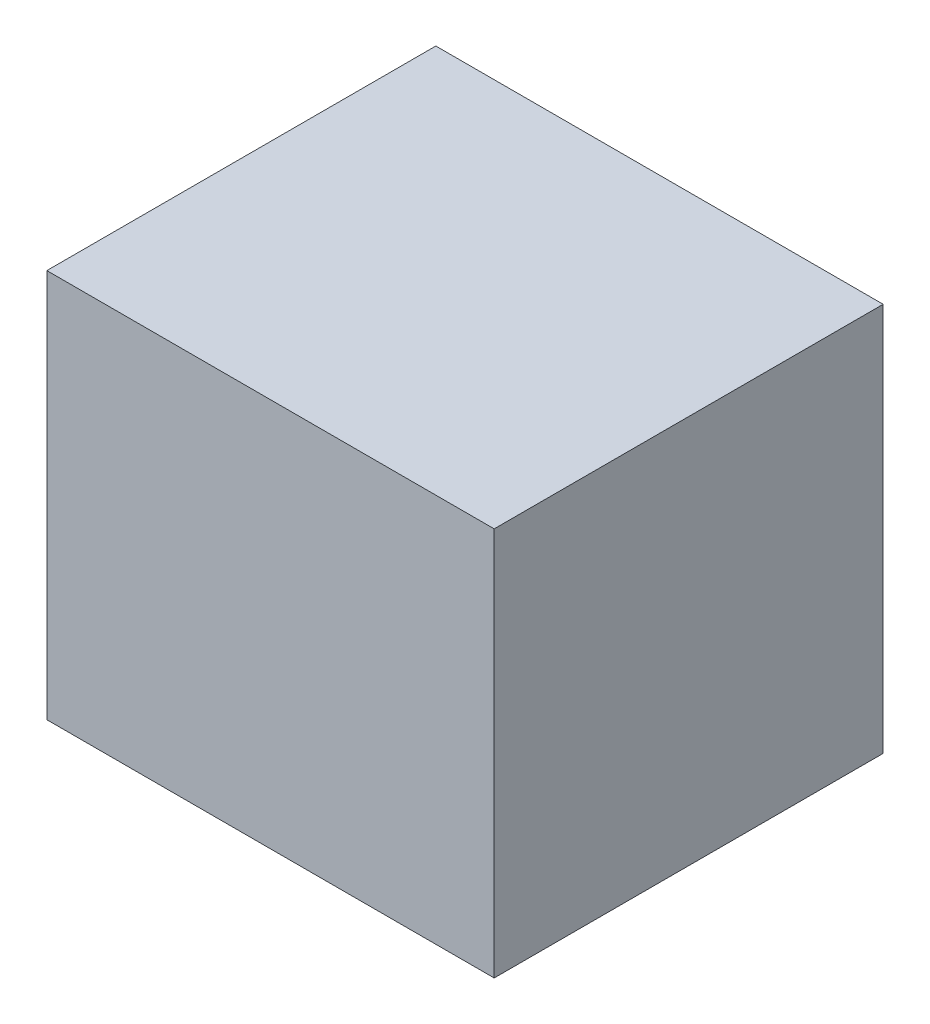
ISO-10303-21;
HEADER;
FILE_DESCRIPTION(('STEP AP214'),'2;1');
FILE_NAME('part.step','',(''),(''),'','','');
FILE_SCHEMA(('AUTOMOTIVE_DESIGN { 1 0 10303 214 1 1 1 1 }'));
ENDSEC;
DATA;
#1=APPLICATION_CONTEXT('core data for automotive mechanical design processes');
#2=APPLICATION_PROTOCOL_DEFINITION('international standard','automotive_design',2000,#1);
#3=PRODUCT_CONTEXT('',#1,'mechanical');
#4=PRODUCT('Part','Part','',(#3));
#5=PRODUCT_RELATED_PRODUCT_CATEGORY('part','',(#4));
#6=PRODUCT_DEFINITION_FORMATION('','',#4);
#7=PRODUCT_DEFINITION_CONTEXT('part definition',#1,'design');
#8=PRODUCT_DEFINITION('design','',#6,#7);
#9=PRODUCT_DEFINITION_SHAPE('','',#8);
#10=(LENGTH_UNIT() NAMED_UNIT(*) SI_UNIT(.MILLI.,.METRE.));
#11=(NAMED_UNIT(*) PLANE_ANGLE_UNIT() SI_UNIT($,.RADIAN.));
#12=(NAMED_UNIT(*) SI_UNIT($,.STERADIAN.) SOLID_ANGLE_UNIT());
#13=UNCERTAINTY_MEASURE_WITH_UNIT(LENGTH_MEASURE(1.E-05),#10,'distance_accuracy_value','');
#14=(GEOMETRIC_REPRESENTATION_CONTEXT(3) GLOBAL_UNCERTAINTY_ASSIGNED_CONTEXT((#13)) GLOBAL_UNIT_ASSIGNED_CONTEXT((#10,
#11,#12)) REPRESENTATION_CONTEXT('',''));
#15=CARTESIAN_POINT('',(0.,0.,0.));
#16=DIRECTION('',(0.,0.,1.));
#17=DIRECTION('',(1.,0.,0.));
#18=AXIS2_PLACEMENT_3D('',#15,#16,#17);
#19=CARTESIAN_POINT('',(0.,0.,400.));
#20=DIRECTION('',(0.,0.,1.));
#21=DIRECTION('',(1.,0.,0.));
#22=AXIS2_PLACEMENT_3D('',#19,#20,#21);
#23=PLANE('',#22);
#24=DIRECTION('',(1.,0.,0.));
#25=VECTOR('',#24,1.);
#26=CARTESIAN_POINT('',(-230.,-200.,400.));
#27=LINE('',#26,#25);
#28=CARTESIAN_POINT('',(-230.,-200.,400.));
#29=VERTEX_POINT('',#28);
#30=CARTESIAN_POINT('',(230.,-200.,400.));
#31=VERTEX_POINT('',#30);
#32=EDGE_CURVE('E81',#29,#31,#27,.T.);
#33=ORIENTED_EDGE('',*,*,#32,.T.);
#34=DIRECTION('',(0.,1.,0.));
#35=VECTOR('',#34,1.);
#36=CARTESIAN_POINT('',(230.,-200.,400.));
#37=LINE('',#36,#35);
#38=CARTESIAN_POINT('',(230.,200.,400.));
#39=VERTEX_POINT('',#38);
#40=EDGE_CURVE('E103',#31,#39,#37,.T.);
#41=ORIENTED_EDGE('',*,*,#40,.T.);
#42=DIRECTION('',(-1.,0.,0.));
#43=VECTOR('',#42,1.);
#44=CARTESIAN_POINT('',(230.,200.,400.));
#45=LINE('',#44,#43);
#46=CARTESIAN_POINT('',(-230.,200.,400.));
#47=VERTEX_POINT('',#46);
#48=EDGE_CURVE('E74',#39,#47,#45,.T.);
#49=ORIENTED_EDGE('',*,*,#48,.T.);
#50=DIRECTION('',(0.,-1.,0.));
#51=VECTOR('',#50,1.);
#52=CARTESIAN_POINT('',(-230.,200.,400.));
#53=LINE('',#52,#51);
#54=EDGE_CURVE('E10',#47,#29,#53,.T.);
#55=ORIENTED_EDGE('',*,*,#54,.T.);
#56=EDGE_LOOP('',(#33,#41,#49,#55));
#57=FACE_BOUND('',#56,.T.);
#58=ADVANCED_FACE('F16',(#57),#23,.T.);
#59=CARTESIAN_POINT('',(0.,0.,0.));
#60=DIRECTION('',(0.,0.,1.));
#61=DIRECTION('',(1.,0.,0.));
#62=AXIS2_PLACEMENT_3D('',#59,#60,#61);
#63=PLANE('',#62);
#64=DIRECTION('',(0.,-1.,0.));
#65=VECTOR('',#64,1.);
#66=CARTESIAN_POINT('',(-230.,200.,0.));
#67=LINE('',#66,#65);
#68=CARTESIAN_POINT('',(-230.,200.,0.));
#69=VERTEX_POINT('',#68);
#70=CARTESIAN_POINT('',(-230.,-200.,0.));
#71=VERTEX_POINT('',#70);
#72=EDGE_CURVE('E19',#69,#71,#67,.T.);
#73=ORIENTED_EDGE('',*,*,#72,.F.);
#74=DIRECTION('',(-1.,0.,0.));
#75=VECTOR('',#74,1.);
#76=CARTESIAN_POINT('',(230.,200.,0.));
#77=LINE('',#76,#75);
#78=CARTESIAN_POINT('',(230.,200.,0.));
#79=VERTEX_POINT('',#78);
#80=EDGE_CURVE('E106',#79,#69,#77,.T.);
#81=ORIENTED_EDGE('',*,*,#80,.F.);
#82=DIRECTION('',(0.,1.,0.));
#83=VECTOR('',#82,1.);
#84=CARTESIAN_POINT('',(230.,-200.,0.));
#85=LINE('',#84,#83);
#86=CARTESIAN_POINT('',(230.,-200.,0.));
#87=VERTEX_POINT('',#86);
#88=EDGE_CURVE('E83',#87,#79,#85,.T.);
#89=ORIENTED_EDGE('',*,*,#88,.F.);
#90=DIRECTION('',(1.,0.,0.));
#91=VECTOR('',#90,1.);
#92=CARTESIAN_POINT('',(-230.,-200.,0.));
#93=LINE('',#92,#91);
#94=EDGE_CURVE('E79',#71,#87,#93,.T.);
#95=ORIENTED_EDGE('',*,*,#94,.F.);
#96=EDGE_LOOP('',(#73,#81,#89,#95));
#97=FACE_BOUND('',#96,.T.);
#98=ADVANCED_FACE('F85',(#97),#63,.F.);
#99=CARTESIAN_POINT('',(-230.,200.,0.));
#100=DIRECTION('',(1.,0.,0.));
#101=DIRECTION('',(0.,1.,0.));
#102=AXIS2_PLACEMENT_3D('',#99,#100,#101);
#103=PLANE('',#102);
#104=ORIENTED_EDGE('',*,*,#72,.T.);
#105=DIRECTION('',(0.,0.,1.));
#106=VECTOR('',#105,1.);
#107=CARTESIAN_POINT('',(-230.,-200.,0.));
#108=LINE('',#107,#106);
#109=EDGE_CURVE('E68',#71,#29,#108,.T.);
#110=ORIENTED_EDGE('',*,*,#109,.T.);
#111=ORIENTED_EDGE('',*,*,#54,.F.);
#112=DIRECTION('',(0.,0.,1.));
#113=VECTOR('',#112,1.);
#114=CARTESIAN_POINT('',(-230.,200.,0.));
#115=LINE('',#114,#113);
#116=EDGE_CURVE('E71',#69,#47,#115,.T.);
#117=ORIENTED_EDGE('',*,*,#116,.F.);
#118=EDGE_LOOP('',(#104,#110,#111,#117));
#119=FACE_BOUND('',#118,.T.);
#120=ADVANCED_FACE('F67',(#119),#103,.F.);
#121=CARTESIAN_POINT('',(230.,200.,0.));
#122=DIRECTION('',(0.,-1.,0.));
#123=DIRECTION('',(0.,0.,-1.));
#124=AXIS2_PLACEMENT_3D('',#121,#122,#123);
#125=PLANE('',#124);
#126=ORIENTED_EDGE('',*,*,#80,.T.);
#127=ORIENTED_EDGE('',*,*,#116,.T.);
#128=ORIENTED_EDGE('',*,*,#48,.F.);
#129=DIRECTION('',(0.,0.,1.));
#130=VECTOR('',#129,1.);
#131=CARTESIAN_POINT('',(230.,200.,0.));
#132=LINE('',#131,#130);
#133=EDGE_CURVE('E99',#79,#39,#132,.T.);
#134=ORIENTED_EDGE('',*,*,#133,.F.);
#135=EDGE_LOOP('',(#126,#127,#128,#134));
#136=FACE_BOUND('',#135,.T.);
#137=ADVANCED_FACE('F116',(#136),#125,.F.);
#138=CARTESIAN_POINT('',(230.,-200.,0.));
#139=DIRECTION('',(-1.,0.,0.));
#140=DIRECTION('',(0.,0.,1.));
#141=AXIS2_PLACEMENT_3D('',#138,#139,#140);
#142=PLANE('',#141);
#143=ORIENTED_EDGE('',*,*,#88,.T.);
#144=ORIENTED_EDGE('',*,*,#133,.T.);
#145=ORIENTED_EDGE('',*,*,#40,.F.);
#146=DIRECTION('',(0.,0.,1.));
#147=VECTOR('',#146,1.);
#148=CARTESIAN_POINT('',(230.,-200.,0.));
#149=LINE('',#148,#147);
#150=EDGE_CURVE('E89',#87,#31,#149,.T.);
#151=ORIENTED_EDGE('',*,*,#150,.F.);
#152=EDGE_LOOP('',(#143,#144,#145,#151));
#153=FACE_BOUND('',#152,.T.);
#154=ADVANCED_FACE('F118',(#153),#142,.F.);
#155=CARTESIAN_POINT('',(-230.,-200.,0.));
#156=DIRECTION('',(0.,1.,0.));
#157=DIRECTION('',(1.,0.,0.));
#158=AXIS2_PLACEMENT_3D('',#155,#156,#157);
#159=PLANE('',#158);
#160=ORIENTED_EDGE('',*,*,#94,.T.);
#161=ORIENTED_EDGE('',*,*,#150,.T.);
#162=ORIENTED_EDGE('',*,*,#32,.F.);
#163=ORIENTED_EDGE('',*,*,#109,.F.);
#164=EDGE_LOOP('',(#160,#161,#162,#163));
#165=FACE_BOUND('',#164,.T.);
#166=ADVANCED_FACE('F77',(#165),#159,.F.);
#167=CLOSED_SHELL('',(#58,#98,#120,#137,#154,#166));
#168=MANIFOLD_SOLID_BREP('B1',#167);
#169=ADVANCED_BREP_SHAPE_REPRESENTATION('',(#18,#168),#14);
#170=SHAPE_DEFINITION_REPRESENTATION(#9,#169);
ENDSEC;
END-ISO-10303-21;
